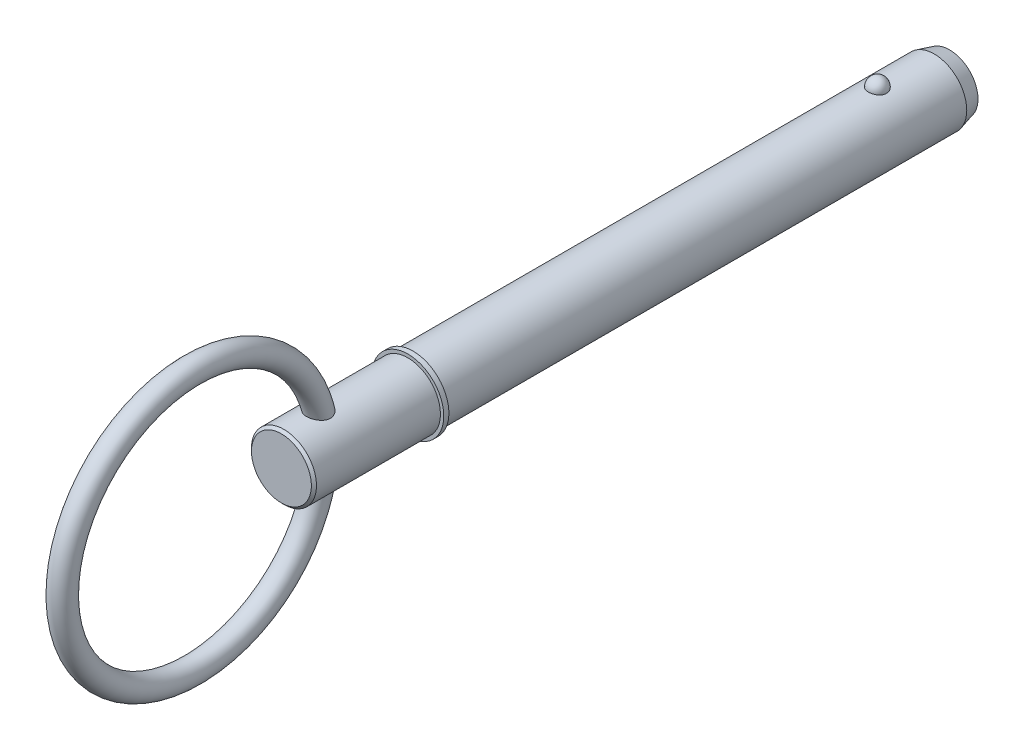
ISO-10303-21;
HEADER;
FILE_DESCRIPTION(('STEP AP214'),'2;1');
FILE_NAME('part.step','',(''),(''),'','','');
FILE_SCHEMA(('AUTOMOTIVE_DESIGN { 1 0 10303 214 1 1 1 1 }'));
ENDSEC;
DATA;
#1=APPLICATION_CONTEXT('core data for automotive mechanical design processes');
#2=APPLICATION_PROTOCOL_DEFINITION('international standard','automotive_design',2000,#1);
#3=PRODUCT_CONTEXT('',#1,'mechanical');
#4=PRODUCT('Part','Part','',(#3));
#5=PRODUCT_RELATED_PRODUCT_CATEGORY('part','',(#4));
#6=PRODUCT_DEFINITION_FORMATION('','',#4);
#7=PRODUCT_DEFINITION_CONTEXT('part definition',#1,'design');
#8=PRODUCT_DEFINITION('design','',#6,#7);
#9=PRODUCT_DEFINITION_SHAPE('','',#8);
#10=(LENGTH_UNIT() NAMED_UNIT(*) SI_UNIT(.MILLI.,.METRE.));
#11=(NAMED_UNIT(*) PLANE_ANGLE_UNIT() SI_UNIT($,.RADIAN.));
#12=(NAMED_UNIT(*) SI_UNIT($,.STERADIAN.) SOLID_ANGLE_UNIT());
#13=UNCERTAINTY_MEASURE_WITH_UNIT(LENGTH_MEASURE(1.E-05),#10,'distance_accuracy_value','');
#14=(GEOMETRIC_REPRESENTATION_CONTEXT(3) GLOBAL_UNCERTAINTY_ASSIGNED_CONTEXT((#13)) GLOBAL_UNIT_ASSIGNED_CONTEXT((#10,
#11,#12)) REPRESENTATION_CONTEXT('',''));
#15=CARTESIAN_POINT('',(0.,0.,0.));
#16=DIRECTION('',(0.,0.,1.));
#17=DIRECTION('',(1.,0.,0.));
#18=AXIS2_PLACEMENT_3D('',#15,#16,#17);
#19=CARTESIAN_POINT('',(0.,0.,88.9));
#20=DIRECTION('',(0.,0.,-1.));
#21=DIRECTION('',(-1.,0.,0.));
#22=AXIS2_PLACEMENT_3D('',#19,#20,#21);
#23=CYLINDRICAL_SURFACE('',#22,6.35);
#24=CARTESIAN_POINT('',(1.76243001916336,6.10051968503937,-1.78));
#25=CARTESIAN_POINT('',(1.76242835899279,6.10052111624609,-1.68050311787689));
#26=CARTESIAN_POINT('',(1.75431593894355,6.1028816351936,-1.58098521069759));
#27=CARTESIAN_POINT('',(1.72206027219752,6.11206037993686,-1.38476972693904));
#28=CARTESIAN_POINT('',(1.69791106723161,6.11888026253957,-1.28807321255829));
#29=CARTESIAN_POINT('',(1.63419596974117,6.13620287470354,-1.10029899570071));
#30=CARTESIAN_POINT('',(1.59463684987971,6.14670398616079,-1.00921884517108));
#31=CARTESIAN_POINT('',(1.50108569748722,6.17021534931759,-0.835161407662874));
#32=CARTESIAN_POINT('',(1.44709398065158,6.18322554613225,-0.752183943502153));
#33=CARTESIAN_POINT('',(1.32572431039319,6.21038081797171,-0.596209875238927));
#34=CARTESIAN_POINT('',(1.2582815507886,6.22453118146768,-0.523264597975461));
#35=CARTESIAN_POINT('',(1.11191624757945,6.25233390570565,-0.38985550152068));
#36=CARTESIAN_POINT('',(1.03299369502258,6.26598626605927,-0.3293916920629));
#37=CARTESIAN_POINT('',(0.866022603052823,6.29123226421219,-0.222793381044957));
#38=CARTESIAN_POINT('',(0.778000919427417,6.30283170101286,-0.176618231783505));
#39=CARTESIAN_POINT('',(0.595108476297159,6.32272058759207,-0.0996905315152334));
#40=CARTESIAN_POINT('',(0.500238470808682,6.33101040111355,-0.0689362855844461));
#41=CARTESIAN_POINT('',(0.308164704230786,6.34323464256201,-0.0241595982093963));
#42=CARTESIAN_POINT('',(0.211033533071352,6.34724467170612,-0.00984637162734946));
#43=CARTESIAN_POINT('',(0.0156629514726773,6.3507318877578,0.00262058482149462));
#44=CARTESIAN_POINT('',(-0.0825763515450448,6.35020951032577,0.000775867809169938));
#45=CARTESIAN_POINT('',(-0.275890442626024,6.34473055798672,-0.0188727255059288));
#46=CARTESIAN_POINT('',(-0.370990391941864,6.3398374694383,-0.0364481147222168));
#47=CARTESIAN_POINT('',(-0.556805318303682,6.32622723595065,-0.0867447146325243));
#48=CARTESIAN_POINT('',(-0.64752021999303,6.31751002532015,-0.11946618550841));
#49=CARTESIAN_POINT('',(-0.82260655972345,6.29711353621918,-0.199386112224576));
#50=CARTESIAN_POINT('',(-0.906938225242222,6.28541739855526,-0.24666729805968));
#51=CARTESIAN_POINT('',(-1.06646479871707,6.26032612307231,-0.354365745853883));
#52=CARTESIAN_POINT('',(-1.14165877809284,6.24693081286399,-0.414784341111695));
#53=CARTESIAN_POINT('',(-1.2823514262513,6.21959142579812,-0.548435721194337));
#54=CARTESIAN_POINT('',(-1.34763761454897,6.2056417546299,-0.621891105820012));
#55=CARTESIAN_POINT('',(-1.4651153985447,6.1789624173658,-0.778815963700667));
#56=CARTESIAN_POINT('',(-1.51730606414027,6.16623283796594,-0.862286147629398));
#57=CARTESIAN_POINT('',(-1.60782211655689,6.14325839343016,-1.0379915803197));
#58=CARTESIAN_POINT('',(-1.64598111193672,6.13304379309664,-1.13031660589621));
#59=CARTESIAN_POINT('',(-1.70661885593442,6.11644899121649,-1.32030667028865));
#60=CARTESIAN_POINT('',(-1.72909805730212,6.11006867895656,-1.41797155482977));
#61=CARTESIAN_POINT('',(-1.75775019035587,6.1018881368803,-1.61543246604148));
#62=CARTESIAN_POINT('',(-1.76399136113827,6.10006874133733,-1.71521779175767));
#63=CARTESIAN_POINT('',(-1.76020715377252,6.10116172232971,-1.91445126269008));
#64=CARTESIAN_POINT('',(-1.750182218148,6.10407397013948,-2.01389941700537));
#65=CARTESIAN_POINT('',(-1.71421005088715,6.11427232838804,-2.20912106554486));
#66=CARTESIAN_POINT('',(-1.68834262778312,6.12153651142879,-2.30491043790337));
#67=CARTESIAN_POINT('',(-1.62139543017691,6.1396067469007,-2.49066180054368));
#68=CARTESIAN_POINT('',(-1.5803150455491,6.15041294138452,-2.58062355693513));
#69=CARTESIAN_POINT('',(-1.48369112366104,6.17443456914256,-2.75271428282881));
#70=CARTESIAN_POINT('',(-1.42806998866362,6.18766281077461,-2.83479789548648));
#71=CARTESIAN_POINT('',(-1.30386620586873,6.21501934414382,-2.98832532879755));
#72=CARTESIAN_POINT('',(-1.23528306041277,6.22914767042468,-3.05976874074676));
#73=CARTESIAN_POINT('',(-1.08663999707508,6.25679135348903,-3.19029656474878));
#74=CARTESIAN_POINT('',(-1.00653826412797,6.27030422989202,-3.24933392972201));
#75=CARTESIAN_POINT('',(-0.837212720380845,6.29514770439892,-3.35304657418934));
#76=CARTESIAN_POINT('',(-0.747989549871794,6.30647845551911,-3.39772286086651));
#77=CARTESIAN_POINT('',(-0.564098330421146,6.32556124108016,-3.47096393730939));
#78=CARTESIAN_POINT('',(-0.469512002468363,6.33335611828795,-3.49972259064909));
#79=CARTESIAN_POINT('',(-0.276633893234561,6.34470628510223,-3.54113722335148));
#80=CARTESIAN_POINT('',(-0.17834256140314,6.34826208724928,-3.55379514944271));
#81=CARTESIAN_POINT('',(0.0171660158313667,6.35071525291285,-3.56255473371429));
#82=CARTESIAN_POINT('',(0.114368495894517,6.34969931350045,-3.55896450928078));
#83=CARTESIAN_POINT('',(0.306746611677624,6.34331695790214,-3.53603383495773));
#84=CARTESIAN_POINT('',(0.401922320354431,6.33795069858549,-3.51669395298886));
#85=CARTESIAN_POINT('',(0.587203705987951,6.32347219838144,-3.4629173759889));
#86=CARTESIAN_POINT('',(0.677327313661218,6.31437430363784,-3.42853846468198));
#87=CARTESIAN_POINT('',(0.850462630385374,6.29339543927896,-3.34564128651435));
#88=CARTESIAN_POINT('',(0.933473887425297,6.2815142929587,-3.29712212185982));
#89=CARTESIAN_POINT('',(1.09144542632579,6.25601750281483,-3.18638742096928));
#90=CARTESIAN_POINT('',(1.16626195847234,6.24237795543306,-3.12397237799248));
#91=CARTESIAN_POINT('',(1.30444862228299,6.21497285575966,-2.98755865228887));
#92=CARTESIAN_POINT('',(1.36781676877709,6.20120728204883,-2.91355796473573));
#93=CARTESIAN_POINT('',(1.48252779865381,6.17479923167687,-2.75456133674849));
#94=CARTESIAN_POINT('',(1.53364167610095,6.16218052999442,-2.66939613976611));
#95=CARTESIAN_POINT('',(1.62109397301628,6.13975602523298,-2.49147502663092));
#96=CARTESIAN_POINT('',(1.657437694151,6.12994921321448,-2.39872184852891));
#97=CARTESIAN_POINT('',(1.71127844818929,6.11512175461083,-2.21887622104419));
#98=CARTESIAN_POINT('',(1.73042646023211,6.10968903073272,-2.13230770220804));
#99=CARTESIAN_POINT('',(1.75600284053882,6.10238739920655,-1.95716498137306));
#100=CARTESIAN_POINT('',(1.76243149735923,6.10051841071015,-1.86859082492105));
#101=CARTESIAN_POINT('',(1.76243001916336,6.10051968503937,-1.78));
#102=B_SPLINE_CURVE_WITH_KNOTS('',3,(#24,#25,#26,#27,#28,#29,#30,#31,#32,#33,#34,#35,#36,#37,
#38,#39,#40,#41,#42,#43,#44,#45,#46,#47,#48,#49,#50,#51,#52,#53,#54,#55,#56,#57,#58,#59,#60,#61,
#62,#63,#64,#65,#66,#67,#68,#69,#70,#71,#72,#73,#74,#75,#76,#77,#78,#79,#80,#81,#82,#83,#84,#85,
#86,#87,#88,#89,#90,#91,#92,#93,#94,#95,#96,#97,#98,#99,#100,#101),.UNSPECIFIED.,.T.,.F.,(4,2,2,
2,2,2,2,2,2,2,2,2,2,2,2,2,2,2,2,2,2,2,2,2,2,2,2,2,2,2,2,2,2,2,2,2,2,2,4),(0.,0.298172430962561,
0.596455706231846,0.894608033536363,1.19275383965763,1.49237238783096,1.79199116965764,
2.09074960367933,2.38947519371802,2.68283180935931,2.97616022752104,3.26529599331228,
3.55443672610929,3.84525169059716,4.13609618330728,4.43249276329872,4.72891038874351,
5.02873757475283,5.32855610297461,5.62711261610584,5.92566100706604,6.22271765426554,
6.51978621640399,6.81847366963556,7.11717259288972,7.41698459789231,7.71677557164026,
8.01283014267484,8.30884891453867,8.59927798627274,8.88969658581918,9.17900899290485,
9.46833977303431,9.76212836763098,10.0559678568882,10.3549321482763,10.6537890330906,
10.9192841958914,11.1847733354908),.UNSPECIFIED.);
#103=CARTESIAN_POINT('',(1.76243001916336,6.10051968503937,-1.78));
#104=VERTEX_POINT('',#103);
#105=EDGE_CURVE('E102',#104,#104,#102,.T.);
#106=ORIENTED_EDGE('',*,*,#105,.T.);
#107=EDGE_LOOP('',(#106));
#108=FACE_BOUND('',#107,.T.);
#109=CARTESIAN_POINT('',(0.,0.,-12.8799999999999));
#110=DIRECTION('',(0.,0.,-1.));
#111=DIRECTION('',(-1.,0.,0.));
#112=AXIS2_PLACEMENT_3D('',#109,#110,#111);
#113=CIRCLE('',#112,6.35);
#114=CARTESIAN_POINT('',(6.35,0.,-12.8799999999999));
#115=VERTEX_POINT('',#114);
#116=EDGE_CURVE('E110',#115,#115,#113,.F.);
#117=ORIENTED_EDGE('',*,*,#116,.T.);
#118=EDGE_LOOP('',(#117));
#119=FACE_BOUND('',#118,.T.);
#120=CARTESIAN_POINT('',(0.,0.,88.9));
#121=DIRECTION('',(0.,0.,1.));
#122=DIRECTION('',(1.,0.,0.));
#123=AXIS2_PLACEMENT_3D('',#120,#121,#122);
#124=CIRCLE('',#123,6.35);
#125=CARTESIAN_POINT('',(6.35,0.,88.9));
#126=VERTEX_POINT('',#125);
#127=EDGE_CURVE('E108',#126,#126,#124,.T.);
#128=ORIENTED_EDGE('',*,*,#127,.F.);
#129=EDGE_LOOP('',(#128));
#130=FACE_BOUND('',#129,.T.);
#131=ADVANCED_FACE('F39',(#108,#119,#130),#23,.T.);
#132=CARTESIAN_POINT('',(0.,0.,-15.88));
#133=DIRECTION('',(0.,0.,-1.));
#134=DIRECTION('',(-1.,0.,0.));
#135=AXIS2_PLACEMENT_3D('',#132,#133,#134);
#136=PLANE('',#135);
#137=CARTESIAN_POINT('',(0.,0.,-15.88));
#138=DIRECTION('',(0.,0.,-1.));
#139=DIRECTION('',(-1.,0.,0.));
#140=AXIS2_PLACEMENT_3D('',#137,#138,#139);
#141=CIRCLE('',#140,5.54615242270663);
#142=CARTESIAN_POINT('',(5.54615242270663,0.,-15.88));
#143=VERTEX_POINT('',#142);
#144=EDGE_CURVE('E143',#143,#143,#141,.T.);
#145=ORIENTED_EDGE('',*,*,#144,.T.);
#146=EDGE_LOOP('',(#145));
#147=FACE_BOUND('',#146,.T.);
#148=ADVANCED_FACE('F88',(#147),#136,.T.);
#149=CARTESIAN_POINT('',(0.,0.,-15.88));
#150=DIRECTION('',(0.,0.,1.));
#151=DIRECTION('',(1.,0.,0.));
#152=AXIS2_PLACEMENT_3D('',#149,#150,#151);
#153=CONICAL_SURFACE('',#152,5.54615242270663,0.261799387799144);
#154=CARTESIAN_POINT('',(6.35,0.,-12.8799999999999));
#155=CARTESIAN_POINT('',(6.34162658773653,0.,-12.9112499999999));
#156=CARTESIAN_POINT('',(6.33325317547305,0.,-12.9424999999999));
#157=CARTESIAN_POINT('',(6.31650635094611,0.,-13.0049999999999));
#158=CARTESIAN_POINT('',(6.30813293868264,0.,-13.0362499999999));
#159=CARTESIAN_POINT('',(6.29138611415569,0.,-13.0987499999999));
#160=CARTESIAN_POINT('',(6.28301270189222,0.,-13.1299999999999));
#161=CARTESIAN_POINT('',(6.26626587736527,0.,-13.1924999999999));
#162=CARTESIAN_POINT('',(6.2578924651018,0.,-13.2237499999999));
#163=CARTESIAN_POINT('',(6.24114564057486,0.,-13.2862499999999));
#164=CARTESIAN_POINT('',(6.23277222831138,0.,-13.3174999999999));
#165=CARTESIAN_POINT('',(6.21602540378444,0.,-13.3799999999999));
#166=CARTESIAN_POINT('',(6.20765199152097,0.,-13.4112499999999));
#167=CARTESIAN_POINT('',(6.19090516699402,0.,-13.4737499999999));
#168=CARTESIAN_POINT('',(6.18253175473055,0.,-13.5049999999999));
#169=CARTESIAN_POINT('',(6.1657849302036,0.,-13.5674999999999));
#170=CARTESIAN_POINT('',(6.15741151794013,0.,-13.5987499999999));
#171=CARTESIAN_POINT('',(6.14066469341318,0.,-13.6612499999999));
#172=CARTESIAN_POINT('',(6.13229128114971,0.,-13.6925));
#173=CARTESIAN_POINT('',(6.11554445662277,0.,-13.755));
#174=CARTESIAN_POINT('',(6.1071710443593,0.,-13.78625));
#175=CARTESIAN_POINT('',(6.09042421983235,0.,-13.84875));
#176=CARTESIAN_POINT('',(6.08205080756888,0.,-13.88));
#177=CARTESIAN_POINT('',(6.06530398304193,0.,-13.9425));
#178=CARTESIAN_POINT('',(6.05693057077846,0.,-13.97375));
#179=CARTESIAN_POINT('',(6.04018374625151,0.,-14.03625));
#180=CARTESIAN_POINT('',(6.03181033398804,0.,-14.0675));
#181=CARTESIAN_POINT('',(6.0150635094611,0.,-14.13));
#182=CARTESIAN_POINT('',(6.00669009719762,0.,-14.16125));
#183=CARTESIAN_POINT('',(5.98994327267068,0.,-14.22375));
#184=CARTESIAN_POINT('',(5.98156986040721,0.,-14.255));
#185=CARTESIAN_POINT('',(5.96482303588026,0.,-14.3175));
#186=CARTESIAN_POINT('',(5.95644962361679,0.,-14.34875));
#187=CARTESIAN_POINT('',(5.93970279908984,0.,-14.41125));
#188=CARTESIAN_POINT('',(5.93132938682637,0.,-14.4425));
#189=CARTESIAN_POINT('',(5.91458256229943,0.,-14.505));
#190=CARTESIAN_POINT('',(5.90620915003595,0.,-14.53625));
#191=CARTESIAN_POINT('',(5.88946232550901,0.,-14.59875));
#192=CARTESIAN_POINT('',(5.88108891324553,0.,-14.63));
#193=CARTESIAN_POINT('',(5.86434208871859,0.,-14.6925));
#194=CARTESIAN_POINT('',(5.85596867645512,0.,-14.72375));
#195=CARTESIAN_POINT('',(5.83922185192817,0.,-14.78625));
#196=CARTESIAN_POINT('',(5.8308484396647,0.,-14.8175));
#197=CARTESIAN_POINT('',(5.81410161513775,0.,-14.88));
#198=CARTESIAN_POINT('',(5.80572820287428,0.,-14.91125));
#199=CARTESIAN_POINT('',(5.78898137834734,0.,-14.97375));
#200=CARTESIAN_POINT('',(5.78060796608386,0.,-15.005));
#201=CARTESIAN_POINT('',(5.76386114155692,0.,-15.0675));
#202=CARTESIAN_POINT('',(5.75548772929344,0.,-15.09875));
#203=CARTESIAN_POINT('',(5.7387409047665,0.,-15.16125));
#204=CARTESIAN_POINT('',(5.73036749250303,0.,-15.1925));
#205=CARTESIAN_POINT('',(5.71362066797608,0.,-15.255));
#206=CARTESIAN_POINT('',(5.70524725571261,0.,-15.28625));
#207=CARTESIAN_POINT('',(5.68850043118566,0.,-15.34875));
#208=CARTESIAN_POINT('',(5.68012701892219,0.,-15.38));
#209=CARTESIAN_POINT('',(5.66338019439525,0.,-15.4425));
#210=CARTESIAN_POINT('',(5.65500678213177,0.,-15.47375));
#211=CARTESIAN_POINT('',(5.63825995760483,0.,-15.53625));
#212=CARTESIAN_POINT('',(5.62988654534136,0.,-15.5675));
#213=CARTESIAN_POINT('',(5.61313972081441,0.,-15.63));
#214=CARTESIAN_POINT('',(5.60476630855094,0.,-15.66125));
#215=CARTESIAN_POINT('',(5.58801948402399,0.,-15.72375));
#216=CARTESIAN_POINT('',(5.57964607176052,0.,-15.755));
#217=CARTESIAN_POINT('',(5.56289924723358,0.,-15.8175));
#218=CARTESIAN_POINT('',(5.5545258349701,0.,-15.84875));
#219=CARTESIAN_POINT('',(5.54615242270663,0.,-15.88));
#220=B_SPLINE_CURVE_WITH_KNOTS('',3,(#154,#155,#156,#157,#158,#159,#160,#161,#162,#163,#164,
#165,#166,#167,#168,#169,#170,#171,#172,#173,#174,#175,#176,#177,#178,#179,#180,#181,#182,#183,
#184,#185,#186,#187,#188,#189,#190,#191,#192,#193,#194,#195,#196,#197,#198,#199,#200,#201,#202,
#203,#204,#205,#206,#207,#208,#209,#210,#211,#212,#213,#214,#215,#216,#217,#218,#219),
.UNSPECIFIED.,.F.,.F.,(4,2,2,2,2,2,2,2,2,2,2,2,2,2,2,2,2,2,2,2,2,2,2,2,2,2,2,2,2,2,2,2,4),(0.,
0.0970571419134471,0.194114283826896,0.291171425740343,0.38822856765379,0.485285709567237,
0.582342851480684,0.679399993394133,0.77645713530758,0.873514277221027,0.970571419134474,
1.06762856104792,1.16468570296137,1.26174284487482,1.35879998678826,1.45585712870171,
1.55291427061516,1.64997141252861,1.74702855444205,1.8440856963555,1.94114283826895,
2.0381999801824,2.13525712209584,2.23231426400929,2.32937140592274,2.42642854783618,
2.52348568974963,2.62054283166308,2.71759997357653,2.81465711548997,2.91171425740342,
3.00877139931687,3.10582854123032),.UNSPECIFIED.);
#221=EDGE_CURVE('BSEAM94',#115,#143,#220,.T.);
#222=ORIENTED_EDGE('',*,*,#116,.F.);
#223=ORIENTED_EDGE('',*,*,#144,.F.);
#224=ORIENTED_EDGE('',*,*,#221,.T.);
#225=ORIENTED_EDGE('',*,*,#221,.F.);
#226=EDGE_LOOP('',(#222,#224,#223,#225));
#227=FACE_BOUND('',#226,.T.);
#228=ADVANCED_FACE('F94',(#227),#153,.T.);
#229=CARTESIAN_POINT('',(0.,6.35,-1.78));
#230=DIRECTION('',(0.,1.,0.));
#231=DIRECTION('',(0.,0.,-1.));
#232=AXIS2_PLACEMENT_3D('',#229,#230,#231);
#233=SPHERICAL_SURFACE('',#232,1.78);
#234=ORIENTED_EDGE('',*,*,#105,.F.);
#235=EDGE_LOOP('',(#234));
#236=FACE_BOUND('',#235,.T.);
#237=ADVANCED_FACE('F113',(#236),#233,.T.);
#238=CARTESIAN_POINT('',(0.,0.,88.9));
#239=DIRECTION('',(0.,0.,-1.));
#240=DIRECTION('',(-1.,0.,0.));
#241=AXIS2_PLACEMENT_3D('',#238,#239,#240);
#242=PLANE('',#241);
#243=ORIENTED_EDGE('',*,*,#127,.T.);
#244=EDGE_LOOP('',(#243));
#245=FACE_BOUND('',#244,.T.);
#246=CARTESIAN_POINT('',(0.,0.,88.9));
#247=DIRECTION('',(0.,0.,-1.));
#248=DIRECTION('',(-1.,0.,0.));
#249=AXIS2_PLACEMENT_3D('',#246,#247,#248);
#250=CIRCLE('',#249,7.);
#251=CARTESIAN_POINT('',(-7.,0.,88.9));
#252=VERTEX_POINT('',#251);
#253=EDGE_CURVE('E109',#252,#252,#250,.T.);
#254=ORIENTED_EDGE('',*,*,#253,.T.);
#255=EDGE_LOOP('',(#254));
#256=FACE_BOUND('',#255,.T.);
#257=ADVANCED_FACE('F117',(#245,#256),#242,.T.);
#258=CARTESIAN_POINT('',(0.,0.,33.7287874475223));
#259=DIRECTION('',(0.,0.,-1.));
#260=DIRECTION('',(-1.,0.,0.));
#261=AXIS2_PLACEMENT_3D('',#258,#259,#260);
#262=CYLINDRICAL_SURFACE('',#261,7.);
#263=CARTESIAN_POINT('',(0.,0.,89.9));
#264=DIRECTION('',(0.,0.,-1.));
#265=DIRECTION('',(-1.,0.,0.));
#266=AXIS2_PLACEMENT_3D('',#263,#264,#265);
#267=CIRCLE('',#266,7.);
#268=CARTESIAN_POINT('',(-7.,0.,89.9));
#269=VERTEX_POINT('',#268);
#270=EDGE_CURVE('E134',#269,#269,#267,.T.);
#271=ORIENTED_EDGE('',*,*,#270,.T.);
#272=EDGE_LOOP('',(#271));
#273=FACE_BOUND('',#272,.T.);
#274=ORIENTED_EDGE('',*,*,#253,.F.);
#275=EDGE_LOOP('',(#274));
#276=FACE_BOUND('',#275,.T.);
#277=ADVANCED_FACE('F121',(#273,#276),#262,.T.);
#278=CARTESIAN_POINT('',(0.,7.,89.9));
#279=DIRECTION('',(0.,0.,1.));
#280=DIRECTION('',(1.,0.,0.));
#281=AXIS2_PLACEMENT_3D('',#278,#279,#280);
#282=PLANE('',#281);
#283=CARTESIAN_POINT('',(0.,0.,89.9));
#284=DIRECTION('',(0.,0.,1.));
#285=DIRECTION('',(1.,0.,0.));
#286=AXIS2_PLACEMENT_3D('',#283,#284,#285);
#287=CIRCLE('',#286,6.35);
#288=CARTESIAN_POINT('',(6.35,0.,89.9));
#289=VERTEX_POINT('',#288);
#290=EDGE_CURVE('E112',#289,#289,#287,.T.);
#291=ORIENTED_EDGE('',*,*,#290,.F.);
#292=EDGE_LOOP('',(#291));
#293=FACE_BOUND('',#292,.T.);
#294=ORIENTED_EDGE('',*,*,#270,.F.);
#295=EDGE_LOOP('',(#294));
#296=FACE_BOUND('',#295,.T.);
#297=ADVANCED_FACE('F85',(#293,#296),#282,.T.);
#298=CARTESIAN_POINT('',(0.,0.,114.6));
#299=DIRECTION('',(0.,0.,-1.));
#300=DIRECTION('',(-1.,0.,0.));
#301=AXIS2_PLACEMENT_3D('',#298,#299,#300);
#302=CYLINDRICAL_SURFACE('',#301,6.35);
#303=CARTESIAN_POINT('',(-1.08120660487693,-6.25727514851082,105.35158117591));
#304=CARTESIAN_POINT('',(-0.970724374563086,-6.27636409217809,105.293879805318));
#305=CARTESIAN_POINT('',(-0.855136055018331,-6.29329984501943,105.245219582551));
#306=CARTESIAN_POINT('',(-0.616958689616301,-6.32109419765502,105.16705594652));
#307=CARTESIAN_POINT('',(-0.494369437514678,-6.3319526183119,105.13755309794));
#308=CARTESIAN_POINT('',(-0.245606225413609,-6.34647141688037,105.098367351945));
#309=CARTESIAN_POINT('',(-0.119431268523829,-6.35012977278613,105.088690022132));
#310=CARTESIAN_POINT('',(0.132849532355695,-6.34986313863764,105.089400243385));
#311=CARTESIAN_POINT('',(0.258955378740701,-6.34593843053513,105.099787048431));
#312=CARTESIAN_POINT('',(0.50691297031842,-6.33094785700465,105.140285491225));
#313=CARTESIAN_POINT('',(0.628781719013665,-6.31991516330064,105.170305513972));
#314=CARTESIAN_POINT('',(0.865486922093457,-6.29187143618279,105.249308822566));
#315=CARTESIAN_POINT('',(0.980322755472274,-6.27485987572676,105.298293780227));
#316=CARTESIAN_POINT('',(1.20050616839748,-6.23649440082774,105.414540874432));
#317=CARTESIAN_POINT('',(1.30578867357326,-6.21511352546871,105.481917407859));
#318=CARTESIAN_POINT('',(1.50311440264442,-6.17036440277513,105.633359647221));
#319=CARTESIAN_POINT('',(1.59515714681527,-6.14699608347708,105.717425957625));
#320=CARTESIAN_POINT('',(1.76326863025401,-6.10090072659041,105.900247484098));
#321=CARTESIAN_POINT('',(1.83935482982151,-6.07817301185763,105.998986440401));
#322=CARTESIAN_POINT('',(1.97338559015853,-6.03599268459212,106.208703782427));
#323=CARTESIAN_POINT('',(2.03133638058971,-6.01653894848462,106.319677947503));
#324=CARTESIAN_POINT('',(2.1259120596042,-5.98376466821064,106.547018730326));
#325=CARTESIAN_POINT('',(2.16315310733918,-5.97026970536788,106.663104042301));
#326=CARTESIAN_POINT('',(2.21830650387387,-5.94999923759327,106.900318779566));
#327=CARTESIAN_POINT('',(2.2362211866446,-5.94322292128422,107.021447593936));
#328=CARTESIAN_POINT('',(2.25273772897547,-5.93698111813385,107.263281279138));
#329=CARTESIAN_POINT('',(2.25163224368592,-5.93740484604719,107.383964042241));
#330=CARTESIAN_POINT('',(2.23167546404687,-5.94493297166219,107.623620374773));
#331=CARTESIAN_POINT('',(2.21281883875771,-5.9520393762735,107.742593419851));
#332=CARTESIAN_POINT('',(2.15679576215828,-5.97257680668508,107.983836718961));
#333=CARTESIAN_POINT('',(2.11851138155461,-5.98639144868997,108.10581287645));
#334=CARTESIAN_POINT('',(2.02470263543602,-6.01876484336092,108.342284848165));
#335=CARTESIAN_POINT('',(1.96916879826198,-6.03732620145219,108.456776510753));
#336=CARTESIAN_POINT('',(1.8352662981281,-6.07945247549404,108.687995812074));
#337=CARTESIAN_POINT('',(1.75507038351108,-6.10334207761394,108.803611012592));
#338=CARTESIAN_POINT('',(1.57657889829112,-6.15186551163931,109.019894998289));
#339=CARTESIAN_POINT('',(1.47827192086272,-6.17649980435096,109.120554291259));
#340=CARTESIAN_POINT('',(1.26306696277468,-6.22410762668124,109.305023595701));
#341=CARTESIAN_POINT('',(1.14585214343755,-6.24704086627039,109.388478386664));
#342=CARTESIAN_POINT('',(0.896825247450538,-6.28760987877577,109.531400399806));
#343=CARTESIAN_POINT('',(0.765036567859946,-6.30525397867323,109.590905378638));
#344=CARTESIAN_POINT('',(0.509454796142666,-6.330648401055,109.675263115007));
#345=CARTESIAN_POINT('',(0.386964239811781,-6.33940909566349,109.703695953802));
#346=CARTESIAN_POINT('',(0.200813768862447,-6.3471308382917,109.728680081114));
#347=CARTESIAN_POINT('',(0.138353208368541,-6.34880140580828,109.734063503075));
#348=CARTESIAN_POINT('',(0.0131841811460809,-6.35029448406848,109.73887386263));
#349=CARTESIAN_POINT('',(-0.04952425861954,-6.35011719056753,109.738301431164));
#350=CARTESIAN_POINT('',(-0.219860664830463,-6.34710452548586,109.728597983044));
#351=CARTESIAN_POINT('',(-0.327176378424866,-6.34243953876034,109.713576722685));
#352=CARTESIAN_POINT('',(-0.537619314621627,-6.32808248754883,109.666673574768));
#353=CARTESIAN_POINT('',(-0.640746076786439,-6.31838987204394,109.634789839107));
#354=CARTESIAN_POINT('',(-0.841795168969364,-6.29478075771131,109.555337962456));
#355=CARTESIAN_POINT('',(-0.939631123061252,-6.28081033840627,109.50756888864));
#356=CARTESIAN_POINT('',(-1.12690564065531,-6.2499288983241,109.398513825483));
#357=CARTESIAN_POINT('',(-1.21634109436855,-6.2330167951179,109.337222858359));
#358=CARTESIAN_POINT('',(-1.39713031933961,-6.19517308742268,109.194039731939));
#359=CARTESIAN_POINT('',(-1.48711596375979,-6.17400700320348,109.110483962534));
#360=CARTESIAN_POINT('',(-1.65373642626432,-6.13148145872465,108.930996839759));
#361=CARTESIAN_POINT('',(-1.73036130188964,-6.11012186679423,108.83505636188));
#362=CARTESIAN_POINT('',(-1.87908981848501,-6.06616529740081,108.618620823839));
#363=CARTESIAN_POINT('',(-1.94902044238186,-6.04382072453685,108.496572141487));
#364=CARTESIAN_POINT('',(-2.06849605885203,-6.00398244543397,108.242070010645));
#365=CARTESIAN_POINT('',(-2.11803457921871,-5.98649027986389,108.109613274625));
#366=CARTESIAN_POINT('',(-2.19551930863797,-5.95851933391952,107.834593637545));
#367=CARTESIAN_POINT('',(-2.22297667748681,-5.94819998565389,107.691874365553));
#368=CARTESIAN_POINT('',(-2.25222139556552,-5.93719450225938,107.403480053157));
#369=CARTESIAN_POINT('',(-2.25403508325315,-5.93649848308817,107.257808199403));
#370=CARTESIAN_POINT('',(-2.23178480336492,-5.94489150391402,106.983804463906));
#371=CARTESIAN_POINT('',(-2.21035650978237,-5.95298402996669,106.855226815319));
#372=CARTESIAN_POINT('',(-2.14565882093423,-5.97660650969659,106.60440891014));
#373=CARTESIAN_POINT('',(-2.10239634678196,-5.99213410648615,106.482166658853));
#374=CARTESIAN_POINT('',(-1.99913159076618,-6.02732890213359,106.256747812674));
#375=CARTESIAN_POINT('',(-1.94060271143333,-6.04660536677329,106.152829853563));
#376=CARTESIAN_POINT('',(-1.80736340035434,-6.0877569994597,105.956534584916));
#377=CARTESIAN_POINT('',(-1.73265259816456,-6.10963222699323,105.864157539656));
#378=CARTESIAN_POINT('',(-1.56865095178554,-6.15378470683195,105.692603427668));
#379=CARTESIAN_POINT('',(-1.47928749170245,-6.17606344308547,105.613496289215));
#380=CARTESIAN_POINT('',(-1.28858731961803,-6.21864788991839,105.470675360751));
#381=CARTESIAN_POINT('',(-1.18724893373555,-6.23895332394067,105.406963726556));
#382=CARTESIAN_POINT('',(-1.08120660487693,-6.25727514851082,105.35158117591));
#383=B_SPLINE_CURVE_WITH_KNOTS('',3,(#303,#304,#305,#306,#307,#308,#309,#310,#311,#312,#313,
#314,#315,#316,#317,#318,#319,#320,#321,#322,#323,#324,#325,#326,#327,#328,#329,#330,#331,#332,
#333,#334,#335,#336,#337,#338,#339,#340,#341,#342,#343,#344,#345,#346,#347,#348,#349,#350,#351,
#352,#353,#354,#355,#356,#357,#358,#359,#360,#361,#362,#363,#364,#365,#366,#367,#368,#369,#370,
#371,#372,#373,#374,#375,#376,#377,#378,#379,#380,#381,#382),.UNSPECIFIED.,.T.,.F.,(4,2,2,2,2,2,
2,2,2,2,2,2,2,2,2,2,2,2,2,2,2,2,2,2,2,2,2,2,2,2,2,2,2,2,2,2,2,2,2,4),(0.,0.377861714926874,
0.755734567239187,1.13371352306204,1.51167842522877,1.88789208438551,2.26413891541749,
2.64278156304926,3.02143792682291,3.39967776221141,3.77778752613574,4.14394628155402,
4.51006081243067,4.87054720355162,5.23114188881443,5.61534494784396,5.99975934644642,
6.42600522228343,6.85252048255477,7.28711365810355,7.72101899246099,8.0966613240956,
8.28452949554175,8.47237776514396,8.79607953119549,9.11981678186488,9.44781545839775,
9.77593508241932,10.1483085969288,10.5209580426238,10.9463240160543,11.3718248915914,
11.8065046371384,12.2407378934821,12.6304236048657,13.0199858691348,13.3807583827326,
13.7415391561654,14.104165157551,14.4668419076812),.UNSPECIFIED.);
#384=CARTESIAN_POINT('',(-1.08120660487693,-6.25727514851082,105.35158117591));
#385=VERTEX_POINT('',#384);
#386=EDGE_CURVE('E10',#385,#385,#383,.T.);
#387=ORIENTED_EDGE('',*,*,#386,.F.);
#388=EDGE_LOOP('',(#387));
#389=FACE_BOUND('',#388,.T.);
#390=CARTESIAN_POINT('',(-1.08120660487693,6.25727514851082,105.35158117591));
#391=CARTESIAN_POINT('',(-1.19093168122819,6.23831652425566,105.408887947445));
#392=CARTESIAN_POINT('',(-1.29562751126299,6.21723224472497,105.475116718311));
#393=CARTESIAN_POINT('',(-1.49211272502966,6.17302620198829,105.624020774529));
#394=CARTESIAN_POINT('',(-1.58390200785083,6.14990442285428,105.706696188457));
#395=CARTESIAN_POINT('',(-1.75209695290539,6.10411985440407,105.886777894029));
#396=CARTESIAN_POINT('',(-1.82848346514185,6.08145766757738,105.984202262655));
#397=CARTESIAN_POINT('',(-1.96346259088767,6.0392331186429,106.191273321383));
#398=CARTESIAN_POINT('',(-2.02206050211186,6.01966983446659,106.300916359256));
#399=CARTESIAN_POINT('',(-2.11860444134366,5.9863659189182,106.526564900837));
#400=CARTESIAN_POINT('',(-2.15701637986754,5.97249571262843,106.642351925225));
#401=CARTESIAN_POINT('',(-2.21449304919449,5.95142584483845,106.879191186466));
#402=CARTESIAN_POINT('',(-2.23356015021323,5.94422536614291,107.000242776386));
#403=CARTESIAN_POINT('',(-2.25228141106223,5.93715610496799,107.241944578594));
#404=CARTESIAN_POINT('',(-2.25225786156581,5.93716560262,107.362567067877));
#405=CARTESIAN_POINT('',(-2.2344206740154,5.94389982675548,107.602277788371));
#406=CARTESIAN_POINT('',(-2.21660184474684,5.95062651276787,107.721365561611));
#407=CARTESIAN_POINT('',(-2.16272689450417,5.97042554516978,107.962705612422));
#408=CARTESIAN_POINT('',(-2.12559286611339,5.98387086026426,108.084684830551));
#409=CARTESIAN_POINT('',(-2.03409944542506,6.0155857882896,108.321342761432));
#410=CARTESIAN_POINT('',(-1.97973080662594,6.03385799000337,108.436017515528));
#411=CARTESIAN_POINT('',(-1.84828023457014,6.07549301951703,108.667865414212));
#412=CARTESIAN_POINT('',(-1.76936622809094,6.09919386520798,108.783943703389));
#413=CARTESIAN_POINT('',(-1.59344783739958,6.14749881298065,109.001420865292));
#414=CARTESIAN_POINT('',(-1.49643151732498,6.17210350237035,109.102809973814));
#415=CARTESIAN_POINT('',(-1.28333318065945,6.21994692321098,109.289508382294));
#416=CARTESIAN_POINT('',(-1.16685721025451,6.24314005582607,109.3743845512));
#417=CARTESIAN_POINT('',(-0.919062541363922,6.2843871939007,109.52034404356));
#418=CARTESIAN_POINT('',(-0.787766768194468,6.30244898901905,109.581463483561));
#419=CARTESIAN_POINT('',(-0.532335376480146,6.32876911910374,109.66911129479));
#420=CARTESIAN_POINT('',(-0.409516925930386,6.33800211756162,109.699123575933));
#421=CARTESIAN_POINT('',(-0.222636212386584,6.34640533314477,109.726338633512));
#422=CARTESIAN_POINT('',(-0.15989383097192,6.34829860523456,109.732442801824));
#423=CARTESIAN_POINT('',(-0.0340877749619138,6.35021985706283,109.73863417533));
#424=CARTESIAN_POINT('',(0.0289758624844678,6.35024804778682,109.73872206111));
#425=CARTESIAN_POINT('',(0.200008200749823,6.34776620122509,109.730732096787));
#426=CARTESIAN_POINT('',(0.307730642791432,6.34342046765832,109.71675007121));
#427=CARTESIAN_POINT('',(0.51913450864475,6.32963338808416,109.671765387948));
#428=CARTESIAN_POINT('',(0.622815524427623,6.3201915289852,109.640761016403));
#429=CARTESIAN_POINT('',(0.824580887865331,6.2970603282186,109.563086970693));
#430=CARTESIAN_POINT('',(0.922611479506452,6.28333629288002,109.516289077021));
#431=CARTESIAN_POINT('',(1.11039970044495,6.2528858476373,109.409122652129));
#432=CARTESIAN_POINT('',(1.20015435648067,6.23615836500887,109.348749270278));
#433=CARTESIAN_POINT('',(1.38155818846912,6.19866747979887,109.20760245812));
#434=CARTESIAN_POINT('',(1.47187645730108,6.17766310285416,109.125184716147));
#435=CARTESIAN_POINT('',(1.63933626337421,6.135352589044,108.947946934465));
#436=CARTESIAN_POINT('',(1.71646809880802,6.11404624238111,108.853117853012));
#437=CARTESIAN_POINT('',(1.86660460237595,6.07002946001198,108.638851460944));
#438=CARTESIAN_POINT('',(1.93743710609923,6.04755477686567,108.517834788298));
#439=CARTESIAN_POINT('',(2.0589430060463,6.00727604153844,108.265280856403));
#440=CARTESIAN_POINT('',(2.1096091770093,5.98947366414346,108.133739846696));
#441=CARTESIAN_POINT('',(2.18982014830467,5.96062717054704,107.859758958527));
#442=CARTESIAN_POINT('',(2.21877575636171,5.94977267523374,107.717123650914));
#443=CARTESIAN_POINT('',(2.2510475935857,5.93764416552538,107.428595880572));
#444=CARTESIAN_POINT('',(2.25438985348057,5.93636042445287,107.282706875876));
#445=CARTESIAN_POINT('',(2.23498011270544,5.9436885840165,107.007731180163));
#446=CARTESIAN_POINT('',(2.21482640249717,5.95131530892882,106.878434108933));
#447=CARTESIAN_POINT('',(2.15248760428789,5.97414352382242,106.625969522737));
#448=CARTESIAN_POINT('',(2.11031020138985,5.98934237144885,106.502799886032));
#449=CARTESIAN_POINT('',(2.00904610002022,6.02402214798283,106.275783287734));
#450=CARTESIAN_POINT('',(1.95150192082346,6.04308594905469,106.171178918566));
#451=CARTESIAN_POINT('',(1.82009972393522,6.08395083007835,105.973382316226));
#452=CARTESIAN_POINT('',(1.74624088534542,6.10575204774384,105.880190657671));
#453=CARTESIAN_POINT('',(1.58309476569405,6.15008431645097,105.706164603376));
#454=CARTESIAN_POINT('',(1.49360904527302,6.17262128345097,105.625518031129));
#455=CARTESIAN_POINT('',(1.30231515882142,6.21579297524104,105.479836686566));
#456=CARTESIAN_POINT('',(1.20050521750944,6.23642742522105,105.41480416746));
#457=CARTESIAN_POINT('',(0.98378657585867,6.27432316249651,105.2998596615));
#458=CARTESIAN_POINT('',(0.868563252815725,6.29145558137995,105.250497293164));
#459=CARTESIAN_POINT('',(0.630994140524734,6.31970327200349,105.170885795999));
#460=CARTESIAN_POINT('',(0.508648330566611,6.33081852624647,105.140636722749));
#461=CARTESIAN_POINT('',(0.259933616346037,6.34590352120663,105.099879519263));
#462=CARTESIAN_POINT('',(0.133554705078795,6.34985380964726,105.089425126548));
#463=CARTESIAN_POINT('',(-0.119270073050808,6.35013815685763,105.088667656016));
#464=CARTESIAN_POINT('',(-0.245715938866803,6.34647233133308,105.098364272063));
#465=CARTESIAN_POINT('',(-0.494670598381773,6.33192772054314,105.137620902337));
#466=CARTESIAN_POINT('',(-0.617189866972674,6.3210701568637,105.167122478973));
#467=CARTESIAN_POINT('',(-0.855240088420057,6.29328476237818,105.245263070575));
#468=CARTESIAN_POINT('',(-0.970770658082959,6.27635659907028,105.293903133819));
#469=CARTESIAN_POINT('',(-1.08120660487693,6.25727514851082,105.35158117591));
#470=B_SPLINE_CURVE_WITH_KNOTS('',3,(#390,#391,#392,#393,#394,#395,#396,#397,#398,#399,#400,
#401,#402,#403,#404,#405,#406,#407,#408,#409,#410,#411,#412,#413,#414,#415,#416,#417,#418,#419,
#420,#421,#422,#423,#424,#425,#426,#427,#428,#429,#430,#431,#432,#433,#434,#435,#436,#437,#438,
#439,#440,#441,#442,#443,#444,#445,#446,#447,#448,#449,#450,#451,#452,#453,#454,#455,#456,#457,
#458,#459,#460,#461,#462,#463,#464,#465,#466,#467,#468,#469),.UNSPECIFIED.,.T.,.F.,(4,2,2,2,2,2,
2,2,2,2,2,2,2,2,2,2,2,2,2,2,2,2,2,2,2,2,2,2,2,2,2,2,2,2,2,2,2,2,2,4),(0.,0.375258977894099,
0.750520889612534,1.12624651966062,1.50186014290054,1.86837438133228,2.2348437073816,
2.59512638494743,2.95551419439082,3.33859924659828,3.7218901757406,4.14704029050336,
4.57247172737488,5.00788576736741,5.4426352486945,5.82040093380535,6.00932292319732,
6.19822354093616,6.52266071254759,6.84713055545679,7.17430063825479,7.50158780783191,
7.87233275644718,8.24334931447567,8.66748794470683,9.09177840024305,9.52720369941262,
9.96218641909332,10.3532895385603,10.7442562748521,11.1052784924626,11.4663188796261,
11.8323306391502,12.1983951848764,12.5761580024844,12.9539219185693,13.3327099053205,
13.7114921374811,14.0891615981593,14.4668517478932),.UNSPECIFIED.);
#471=CARTESIAN_POINT('',(-1.08120660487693,6.25727514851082,105.35158117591));
#472=VERTEX_POINT('',#471);
#473=EDGE_CURVE('E51',#472,#472,#470,.T.);
#474=ORIENTED_EDGE('',*,*,#473,.F.);
#475=EDGE_LOOP('',(#474));
#476=FACE_BOUND('',#475,.T.);
#477=CARTESIAN_POINT('',(0.,0.,114.1));
#478=DIRECTION('',(0.,0.,-1.));
#479=DIRECTION('',(-1.,0.,0.));
#480=AXIS2_PLACEMENT_3D('',#477,#478,#479);
#481=CIRCLE('',#480,6.35);
#482=CARTESIAN_POINT('',(-6.35,0.,114.1));
#483=VERTEX_POINT('',#482);
#484=EDGE_CURVE('E64',#483,#483,#481,.T.);
#485=ORIENTED_EDGE('',*,*,#484,.T.);
#486=EDGE_LOOP('',(#485));
#487=FACE_BOUND('',#486,.T.);
#488=ORIENTED_EDGE('',*,*,#290,.T.);
#489=EDGE_LOOP('',(#488));
#490=FACE_BOUND('',#489,.T.);
#491=ADVANCED_FACE('F69',(#389,#476,#487,#490),#302,.T.);
#492=CARTESIAN_POINT('',(0.,0.,114.6));
#493=DIRECTION('',(0.,0.,-1.));
#494=DIRECTION('',(-1.,0.,0.));
#495=AXIS2_PLACEMENT_3D('',#492,#493,#494);
#496=PLANE('',#495);
#497=CARTESIAN_POINT('',(0.,0.,114.6));
#498=DIRECTION('',(0.,0.,-1.));
#499=DIRECTION('',(-1.,0.,0.));
#500=AXIS2_PLACEMENT_3D('',#497,#498,#499);
#501=CIRCLE('',#500,5.84999999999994);
#502=CARTESIAN_POINT('',(-5.84999999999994,0.,114.6));
#503=VERTEX_POINT('',#502);
#504=EDGE_CURVE('E58',#503,#503,#501,.F.);
#505=ORIENTED_EDGE('',*,*,#504,.T.);
#506=EDGE_LOOP('',(#505));
#507=FACE_BOUND('',#506,.T.);
#508=ADVANCED_FACE('F76',(#507),#496,.F.);
#509=CARTESIAN_POINT('',(0.,0.,114.1));
#510=DIRECTION('',(0.,0.,-1.));
#511=DIRECTION('',(-1.,0.,0.));
#512=AXIS2_PLACEMENT_3D('',#509,#510,#511);
#513=CONICAL_SURFACE('',#512,6.35,0.785398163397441);
#514=ORIENTED_EDGE('',*,*,#504,.F.);
#515=EDGE_LOOP('',(#514));
#516=FACE_BOUND('',#515,.T.);
#517=ORIENTED_EDGE('',*,*,#484,.F.);
#518=EDGE_LOOP('',(#517));
#519=FACE_BOUND('',#518,.T.);
#520=ADVANCED_FACE('F41',(#516,#519),#513,.T.);
#521=CARTESIAN_POINT('',(0.,0.,132.));
#522=DIRECTION('',(1.,0.,0.));
#523=DIRECTION('',(0.,0.,-1.));
#524=AXIS2_PLACEMENT_3D('',#521,#522,#523);
#525=TOROIDAL_SURFACE('',#524,25.4,2.25);
#526=ORIENTED_EDGE('',*,*,#386,.T.);
#527=EDGE_LOOP('',(#526));
#528=FACE_BOUND('',#527,.T.);
#529=ORIENTED_EDGE('',*,*,#473,.T.);
#530=EDGE_LOOP('',(#529));
#531=FACE_BOUND('',#530,.T.);
#532=ADVANCED_FACE('F73',(#528,#531),#525,.T.);
#533=CLOSED_SHELL('',(#131,#148,#228,#237,#257,#277,#297,#491,#508,#520,#532));
#534=MANIFOLD_SOLID_BREP('B2',#533);
#535=ADVANCED_BREP_SHAPE_REPRESENTATION('',(#18,#534),#14);
#536=SHAPE_DEFINITION_REPRESENTATION(#9,#535);
ENDSEC;
END-ISO-10303-21;
